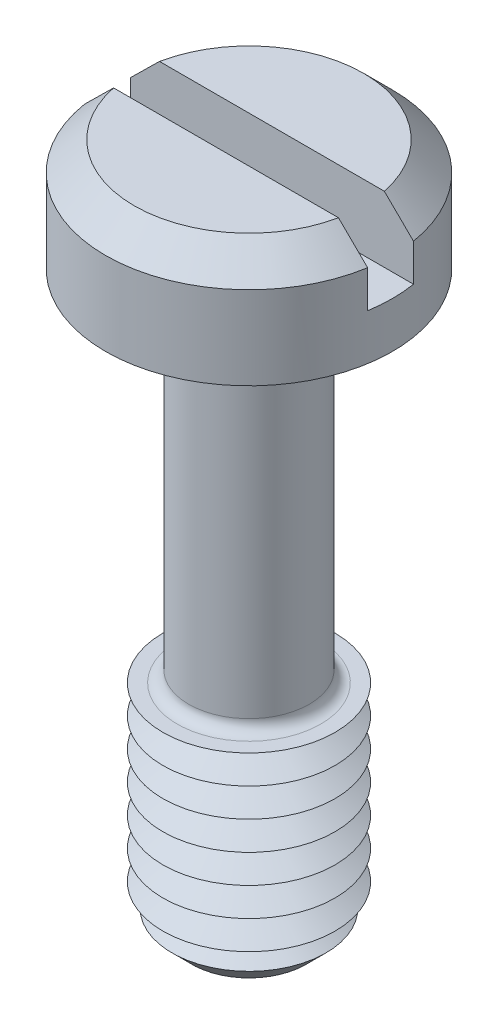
ISO-10303-21;
HEADER;
FILE_DESCRIPTION(('STEP AP214'),'2;1');
FILE_NAME('part.step','',(''),(''),'','','');
FILE_SCHEMA(('AUTOMOTIVE_DESIGN { 1 0 10303 214 1 1 1 1 }'));
ENDSEC;
DATA;
#1=APPLICATION_CONTEXT('core data for automotive mechanical design processes');
#2=APPLICATION_PROTOCOL_DEFINITION('international standard','automotive_design',2000,#1);
#3=PRODUCT_CONTEXT('',#1,'mechanical');
#4=PRODUCT('Part','Part','',(#3));
#5=PRODUCT_RELATED_PRODUCT_CATEGORY('part','',(#4));
#6=PRODUCT_DEFINITION_FORMATION('','',#4);
#7=PRODUCT_DEFINITION_CONTEXT('part definition',#1,'design');
#8=PRODUCT_DEFINITION('design','',#6,#7);
#9=PRODUCT_DEFINITION_SHAPE('','',#8);
#10=(LENGTH_UNIT() NAMED_UNIT(*) SI_UNIT(.MILLI.,.METRE.));
#11=(NAMED_UNIT(*) PLANE_ANGLE_UNIT() SI_UNIT($,.RADIAN.));
#12=(NAMED_UNIT(*) SI_UNIT($,.STERADIAN.) SOLID_ANGLE_UNIT());
#13=UNCERTAINTY_MEASURE_WITH_UNIT(LENGTH_MEASURE(1.E-05),#10,'distance_accuracy_value','');
#14=(GEOMETRIC_REPRESENTATION_CONTEXT(3) GLOBAL_UNCERTAINTY_ASSIGNED_CONTEXT((#13)) GLOBAL_UNIT_ASSIGNED_CONTEXT((#10,
#11,#12)) REPRESENTATION_CONTEXT('',''));
#15=CARTESIAN_POINT('',(0.,0.,0.));
#16=DIRECTION('',(0.,0.,1.));
#17=DIRECTION('',(1.,0.,0.));
#18=AXIS2_PLACEMENT_3D('',#15,#16,#17);
#19=CARTESIAN_POINT('',(0.,3.9,0.));
#20=DIRECTION('',(0.,1.,0.));
#21=DIRECTION('',(0.,0.,1.));
#22=AXIS2_PLACEMENT_3D('',#19,#20,#21);
#23=PLANE('',#22);
#24=DIRECTION('',(-1.,0.,0.));
#25=VECTOR('',#24,1.);
#26=CARTESIAN_POINT('',(5.,3.9,-0.8));
#27=LINE('',#26,#25);
#28=CARTESIAN_POINT('',(3.9191835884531,3.9,-0.8));
#29=VERTEX_POINT('',#28);
#30=CARTESIAN_POINT('',(-3.9191835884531,3.9,-0.8));
#31=VERTEX_POINT('',#30);
#32=EDGE_CURVE('E110',#29,#31,#27,.T.);
#33=ORIENTED_EDGE('',*,*,#32,.F.);
#34=CARTESIAN_POINT('',(0.,3.9,0.));
#35=DIRECTION('',(0.,1.,0.));
#36=DIRECTION('',(0.,0.,1.));
#37=AXIS2_PLACEMENT_3D('',#34,#35,#36);
#38=CIRCLE('',#37,4.00000000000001);
#39=EDGE_CURVE('E113',#29,#31,#38,.T.);
#40=ORIENTED_EDGE('',*,*,#39,.T.);
#41=EDGE_LOOP('',(#33,#40));
#42=FACE_BOUND('',#41,.T.);
#43=ADVANCED_FACE('F39',(#42),#23,.T.);
#44=CARTESIAN_POINT('',(0.,3.9,0.));
#45=DIRECTION('',(0.,-1.,0.));
#46=DIRECTION('',(0.,0.,-1.));
#47=AXIS2_PLACEMENT_3D('',#44,#45,#46);
#48=CONICAL_SURFACE('',#47,4.00000000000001,0.785398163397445);
#49=CARTESIAN_POINT('',(11.0010756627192,-3.13012537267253,-0.8));
#50=CARTESIAN_POINT('',(10.6180645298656,-2.74813121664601,-0.8));
#51=CARTESIAN_POINT('',(10.2350087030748,-2.36618183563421,-0.8));
#52=CARTESIAN_POINT('',(9.4687374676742,-1.60241986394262,-0.8));
#53=CARTESIAN_POINT('',(9.08552205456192,-1.2206072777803,-0.8));
#54=CARTESIAN_POINT('',(8.31861292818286,-0.456918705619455,-0.8));
#55=CARTESIAN_POINT('',(7.93491906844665,-0.0750428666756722,-0.8));
#56=CARTESIAN_POINT('',(7.16722555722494,0.688378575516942,-0.8));
#57=CARTESIAN_POINT('',(6.78322591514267,1.06992418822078,-0.8));
#58=CARTESIAN_POINT('',(6.01856215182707,1.82868912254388,-0.8));
#59=CARTESIAN_POINT('',(5.63790309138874,2.20591354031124,-0.8));
#60=CARTESIAN_POINT('',(5.06622054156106,2.77108317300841,-0.8));
#61=CARTESIAN_POINT('',(4.87553531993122,2.95937045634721,-0.8));
#62=CARTESIAN_POINT('',(4.49384424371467,3.33561647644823,-0.8));
#63=CARTESIAN_POINT('',(4.302838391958,3.52357521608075,-0.8));
#64=CARTESIAN_POINT('',(3.92044271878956,3.89893397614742,-0.8));
#65=CARTESIAN_POINT('',(3.72905310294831,4.08633420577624,-0.8));
#66=CARTESIAN_POINT('',(3.34554223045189,4.46039762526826,-0.8));
#67=CARTESIAN_POINT('',(3.15342094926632,4.64706078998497,-0.8));
#68=CARTESIAN_POINT('',(2.76802565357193,5.0191369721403,-0.8));
#69=CARTESIAN_POINT('',(2.57475182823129,5.20455018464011,-0.8));
#70=CARTESIAN_POINT('',(2.28318236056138,5.48091108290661,-0.8));
#71=CARTESIAN_POINT('',(2.1857187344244,5.5727357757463,-0.8));
#72=CARTESIAN_POINT('',(1.98998431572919,5.75552004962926,-0.8));
#73=CARTESIAN_POINT('',(1.89171354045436,5.84647964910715,-0.8));
#74=CARTESIAN_POINT('',(1.76578543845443,5.96147491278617,-0.8));
#75=CARTESIAN_POINT('',(1.73869031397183,5.986126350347,-0.8));
#76=CARTESIAN_POINT('',(1.68439529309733,6.03531372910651,-0.8));
#77=CARTESIAN_POINT('',(1.65719539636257,6.05984966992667,-0.8));
#78=CARTESIAN_POINT('',(1.5754162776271,6.13326356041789,-0.8));
#79=CARTESIAN_POINT('',(1.52066027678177,6.18194515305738,-0.8));
#80=CARTESIAN_POINT('',(1.41038257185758,6.27874171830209,-0.8));
#81=CARTESIAN_POINT('',(1.35485918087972,6.32685477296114,-0.8));
#82=CARTESIAN_POINT('',(1.24299231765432,6.42210730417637,-0.8));
#83=CARTESIAN_POINT('',(1.18664895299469,6.4692469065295,-0.8));
#84=CARTESIAN_POINT('',(1.07845249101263,6.55754663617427,-0.8));
#85=CARTESIAN_POINT('',(1.02670624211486,6.5988371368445,-0.8));
#86=CARTESIAN_POINT('',(0.92196100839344,6.67979338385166,-0.8));
#87=CARTESIAN_POINT('',(0.868962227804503,6.71945939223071,-0.8));
#88=CARTESIAN_POINT('',(0.761295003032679,6.79630361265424,-0.8));
#89=CARTESIAN_POINT('',(0.706629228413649,6.8334855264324,-0.8));
#90=CARTESIAN_POINT('',(0.594896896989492,6.90399895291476,-0.8));
#91=CARTESIAN_POINT('',(0.537833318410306,6.93733506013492,-0.8));
#92=CARTESIAN_POINT('',(0.428390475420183,6.9935634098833,-0.8));
#93=CARTESIAN_POINT('',(0.376435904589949,7.01726022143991,-0.8));
#94=CARTESIAN_POINT('',(0.269759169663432,7.05717670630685,-0.8));
#95=CARTESIAN_POINT('',(0.215046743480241,7.07342088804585,-0.8));
#96=CARTESIAN_POINT('',(0.113016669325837,7.09332110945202,-0.8));
#97=CARTESIAN_POINT('',(0.0660435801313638,7.098660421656,-0.8));
#98=CARTESIAN_POINT('',(-0.0280587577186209,7.10088875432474,-0.8));
#99=CARTESIAN_POINT('',(-0.0751877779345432,7.09778705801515,-0.8));
#100=CARTESIAN_POINT('',(-0.180723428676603,7.08192474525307,-0.8));
#101=CARTESIAN_POINT('',(-0.238762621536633,7.06679554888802,-0.8));
#102=CARTESIAN_POINT('',(-0.323499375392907,7.03748409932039,-0.8));
#103=CARTESIAN_POINT('',(-0.351441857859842,7.02656594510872,-0.8));
#104=CARTESIAN_POINT('',(-0.406569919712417,7.00295901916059,-0.8));
#105=CARTESIAN_POINT('',(-0.433755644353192,6.99027059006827,-0.8));
#106=CARTESIAN_POINT('',(-0.504673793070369,6.954892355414,-0.8));
#107=CARTESIAN_POINT('',(-0.547808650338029,6.93101671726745,-0.8));
#108=CARTESIAN_POINT('',(-0.632566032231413,6.88069648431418,-0.8));
#109=CARTESIAN_POINT('',(-0.674187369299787,6.85424992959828,-0.8));
#110=CARTESIAN_POINT('',(-0.756326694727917,6.79950439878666,-0.8));
#111=CARTESIAN_POINT('',(-0.796841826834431,6.77120117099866,-0.8));
#112=CARTESIAN_POINT('',(-0.876938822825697,6.71329852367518,-0.8));
#113=CARTESIAN_POINT('',(-0.916520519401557,6.68369887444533,-0.8));
#114=CARTESIAN_POINT('',(-1.03465904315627,6.59312324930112,-0.8));
#115=CARTESIAN_POINT('',(-1.11211338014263,6.53071425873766,-0.8));
#116=CARTESIAN_POINT('',(-1.26505454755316,6.40381418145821,-0.8));
#117=CARTESIAN_POINT('',(-1.34054439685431,6.33932667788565,-0.8));
#118=CARTESIAN_POINT('',(-1.48913173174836,6.20997083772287,-0.8));
#119=CARTESIAN_POINT('',(-1.56224816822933,6.14512422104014,-0.8));
#120=CARTESIAN_POINT('',(-1.70765393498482,6.01451044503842,-0.8));
#121=CARTESIAN_POINT('',(-1.77994324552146,5.94874326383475,-0.8));
#122=CARTESIAN_POINT('',(-1.99594639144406,5.75046596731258,-0.8));
#123=CARTESIAN_POINT('',(-2.13877767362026,5.61699583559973,-0.8));
#124=CARTESIAN_POINT('',(-2.42324632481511,5.34853800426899,-0.8));
#125=CARTESIAN_POINT('',(-2.56488247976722,5.21354902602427,-0.8));
#126=CARTESIAN_POINT('',(-2.84730929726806,4.94270932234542,-0.8));
#127=CARTESIAN_POINT('',(-2.98810001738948,4.80685865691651,-0.8));
#128=CARTESIAN_POINT('',(-3.26818763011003,4.53549974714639,-0.8));
#129=CARTESIAN_POINT('',(-3.40748821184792,4.39999530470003,-0.8));
#130=CARTESIAN_POINT('',(-3.68570899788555,4.12859172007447,-0.8));
#131=CARTESIAN_POINT('',(-3.82462919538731,3.99269257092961,-0.8));
#132=CARTESIAN_POINT('',(-4.24087543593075,3.58468153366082,-0.8));
#133=CARTESIAN_POINT('',(-4.51779300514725,3.31215310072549,-0.8));
#134=CARTESIAN_POINT('',(-5.05279381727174,2.78443938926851,-0.8));
#135=CARTESIAN_POINT('',(-5.31091639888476,2.52929393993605,-0.8));
#136=CARTESIAN_POINT('',(-5.82680751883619,2.01864429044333,-0.8));
#137=CARTESIAN_POINT('',(-6.08457605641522,1.76314008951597,-0.8));
#138=CARTESIAN_POINT('',(-6.85760508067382,0.996194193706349,-0.8));
#139=CARTESIAN_POINT('',(-7.37251152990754,0.484395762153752,-0.8));
#140=CARTESIAN_POINT('',(-8.40657233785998,-0.544392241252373,-0.8));
#141=CARTESIAN_POINT('',(-8.92572224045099,-1.0613862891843,-0.8));
#142=CARTESIAN_POINT('',(-9.96362871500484,-2.09560660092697,-0.8));
#143=CARTESIAN_POINT('',(-10.4823853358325,-2.61283281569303,-0.8));
#144=CARTESIAN_POINT('',(-11.0010756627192,-3.13012537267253,-0.8));
#145=B_SPLINE_CURVE_WITH_KNOTS('',3,(#49,#50,#51,#52,#53,#54,#55,#56,#57,#58,#59,#60,#61,#62,
#63,#64,#65,#66,#67,#68,#69,#70,#71,#72,#73,#74,#75,#76,#77,#78,#79,#80,#81,#82,#83,#84,#85,#86,
#87,#88,#89,#90,#91,#92,#93,#94,#95,#96,#97,#98,#99,#100,#101,#102,#103,#104,#105,#106,#107,
#108,#109,#110,#111,#112,#113,#114,#115,#116,#117,#118,#119,#120,#121,#122,#123,#124,#125,#126,
#127,#128,#129,#130,#131,#132,#133,#134,#135,#136,#137,#138,#139,#140,#141,#142,#143,#144),
.UNSPECIFIED.,.F.,.F.,(4,2,2,2,2,2,2,2,2,2,2,2,2,2,2,2,2,2,2,2,2,2,2,2,2,2,2,2,2,2,2,2,2,2,2,2,
2,2,2,2,2,2,2,2,2,2,2,4),(0.,1.62282275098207,3.24569489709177,4.86971791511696,
6.49369278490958,8.10142191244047,8.90535980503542,9.70929063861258,10.5128682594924,
11.3164730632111,12.1199494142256,12.5216659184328,12.9233738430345,13.0332669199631,
13.1431603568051,13.3629580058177,13.5833578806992,13.8037290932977,14.0023112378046,
14.2008612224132,14.3991084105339,14.5971162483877,14.7680800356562,14.9384774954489,
15.0795987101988,15.2205647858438,15.3993585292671,15.4893211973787,15.579266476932,
15.7270328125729,15.8749126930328,16.0231439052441,16.1714014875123,16.4697244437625,
16.7675580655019,17.0607348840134,17.3539186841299,17.9403574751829,18.5273336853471,
19.114269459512,19.697273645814,20.2802881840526,21.4458742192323,22.534698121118,
23.6235243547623,25.8015035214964,27.999501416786,30.1971550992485),.UNSPECIFIED.);
#146=CARTESIAN_POINT('',(4.93558507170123,2.9,-0.8));
#147=VERTEX_POINT('',#146);
#148=EDGE_CURVE('E252',#147,#29,#145,.T.);
#149=ORIENTED_EDGE('',*,*,#148,.F.);
#150=CARTESIAN_POINT('',(0.,2.9,0.));
#151=DIRECTION('',(0.,1.,0.));
#152=DIRECTION('',(0.,0.,1.));
#153=AXIS2_PLACEMENT_3D('',#150,#151,#152);
#154=CIRCLE('',#153,5.);
#155=CARTESIAN_POINT('',(-4.93558507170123,2.9,-0.8));
#156=VERTEX_POINT('',#155);
#157=EDGE_CURVE('E128',#156,#147,#154,.F.);
#158=ORIENTED_EDGE('',*,*,#157,.F.);
#159=EDGE_CURVE('E102',#31,#156,#145,.T.);
#160=ORIENTED_EDGE('',*,*,#159,.F.);
#161=ORIENTED_EDGE('',*,*,#39,.F.);
#162=EDGE_LOOP('',(#149,#158,#160,#161));
#163=FACE_BOUND('',#162,.T.);
#164=ADVANCED_FACE('F214',(#163),#48,.T.);
#165=CARTESIAN_POINT('',(0.,-20.,0.));
#166=DIRECTION('',(0.,1.,0.));
#167=DIRECTION('',(0.,0.,1.));
#168=AXIS2_PLACEMENT_3D('',#165,#166,#167);
#169=CYLINDRICAL_SURFACE('',#168,2.1);
#170=CARTESIAN_POINT('',(0.,-12.1,0.));
#171=DIRECTION('',(0.,-1.,0.));
#172=DIRECTION('',(0.,0.,-1.));
#173=AXIS2_PLACEMENT_3D('',#170,#171,#172);
#174=CIRCLE('',#173,2.1);
#175=CARTESIAN_POINT('',(0.,-12.1,-2.1));
#176=VERTEX_POINT('',#175);
#177=EDGE_CURVE('E123',#176,#176,#174,.F.);
#178=ORIENTED_EDGE('',*,*,#177,.T.);
#179=EDGE_LOOP('',(#178));
#180=FACE_BOUND('',#179,.T.);
#181=CARTESIAN_POINT('',(0.,-0.400000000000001,0.));
#182=DIRECTION('',(0.,1.,0.));
#183=DIRECTION('',(0.,0.,1.));
#184=AXIS2_PLACEMENT_3D('',#181,#182,#183);
#185=CIRCLE('',#184,2.1);
#186=CARTESIAN_POINT('',(0.,-0.400000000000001,2.1));
#187=VERTEX_POINT('',#186);
#188=EDGE_CURVE('E350',#187,#187,#185,.F.);
#189=ORIENTED_EDGE('',*,*,#188,.T.);
#190=EDGE_LOOP('',(#189));
#191=FACE_BOUND('',#190,.T.);
#192=ADVANCED_FACE('F210',(#180,#191),#169,.T.);
#193=CARTESIAN_POINT('',(0.,3.9,0.));
#194=DIRECTION('',(0.,-1.,0.));
#195=DIRECTION('',(0.,0.,-1.));
#196=AXIS2_PLACEMENT_3D('',#193,#194,#195);
#197=CYLINDRICAL_SURFACE('',#196,5.);
#198=ORIENTED_EDGE('',*,*,#157,.T.);
#199=DIRECTION('',(0.,-1.,0.));
#200=VECTOR('',#199,1.);
#201=CARTESIAN_POINT('',(4.93558507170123,3.9,-0.8));
#202=LINE('',#201,#200);
#203=CARTESIAN_POINT('',(4.93558507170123,1.6,-0.8));
#204=VERTEX_POINT('',#203);
#205=EDGE_CURVE('E64',#147,#204,#202,.T.);
#206=ORIENTED_EDGE('',*,*,#205,.T.);
#207=CARTESIAN_POINT('',(0.,1.6,0.));
#208=DIRECTION('',(0.,1.,0.));
#209=DIRECTION('',(0.,0.,1.));
#210=AXIS2_PLACEMENT_3D('',#207,#208,#209);
#211=CIRCLE('',#210,5.);
#212=CARTESIAN_POINT('',(4.93558507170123,1.6,0.8));
#213=VERTEX_POINT('',#212);
#214=EDGE_CURVE('E11',#213,#204,#211,.T.);
#215=ORIENTED_EDGE('',*,*,#214,.F.);
#216=DIRECTION('',(0.,-1.,0.));
#217=VECTOR('',#216,1.);
#218=CARTESIAN_POINT('',(4.93558507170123,3.9,0.8));
#219=LINE('',#218,#217);
#220=CARTESIAN_POINT('',(4.93558507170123,2.9,0.8));
#221=VERTEX_POINT('',#220);
#222=EDGE_CURVE('E268',#213,#221,#219,.F.);
#223=ORIENTED_EDGE('',*,*,#222,.T.);
#224=CARTESIAN_POINT('',(-4.93558507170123,2.9,0.8));
#225=VERTEX_POINT('',#224);
#226=EDGE_CURVE('E120',#221,#225,#154,.F.);
#227=ORIENTED_EDGE('',*,*,#226,.T.);
#228=DIRECTION('',(0.,-1.,0.));
#229=VECTOR('',#228,1.);
#230=CARTESIAN_POINT('',(-4.93558507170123,3.9,0.8));
#231=LINE('',#230,#229);
#232=CARTESIAN_POINT('',(-4.93558507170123,1.6,0.8));
#233=VERTEX_POINT('',#232);
#234=EDGE_CURVE('E96',#225,#233,#231,.T.);
#235=ORIENTED_EDGE('',*,*,#234,.T.);
#236=CARTESIAN_POINT('',(-4.93558507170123,1.6,-0.8));
#237=VERTEX_POINT('',#236);
#238=EDGE_CURVE('E44',#237,#233,#211,.T.);
#239=ORIENTED_EDGE('',*,*,#238,.F.);
#240=DIRECTION('',(0.,-1.,0.));
#241=VECTOR('',#240,1.);
#242=CARTESIAN_POINT('',(-4.93558507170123,3.9,-0.8));
#243=LINE('',#242,#241);
#244=EDGE_CURVE('E273',#237,#156,#243,.F.);
#245=ORIENTED_EDGE('',*,*,#244,.T.);
#246=EDGE_LOOP('',(#198,#206,#215,#223,#227,#235,#239,#245));
#247=FACE_BOUND('',#246,.T.);
#248=CARTESIAN_POINT('',(0.,0.,0.));
#249=DIRECTION('',(0.,1.,0.));
#250=DIRECTION('',(0.,0.,1.));
#251=AXIS2_PLACEMENT_3D('',#248,#249,#250);
#252=CIRCLE('',#251,5.);
#253=CARTESIAN_POINT('',(0.,0.,5.));
#254=VERTEX_POINT('',#253);
#255=EDGE_CURVE('E336',#254,#254,#252,.T.);
#256=ORIENTED_EDGE('',*,*,#255,.T.);
#257=EDGE_LOOP('',(#256));
#258=FACE_BOUND('',#257,.T.);
#259=ADVANCED_FACE('F213',(#247,#258),#197,.T.);
#260=DIRECTION('',(1.,0.,0.));
#261=VECTOR('',#260,1.);
#262=CARTESIAN_POINT('',(5.,3.9,0.8));
#263=LINE('',#262,#261);
#264=CARTESIAN_POINT('',(-3.9191835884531,3.9,0.8));
#265=VERTEX_POINT('',#264);
#266=CARTESIAN_POINT('',(3.9191835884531,3.9,0.8));
#267=VERTEX_POINT('',#266);
#268=EDGE_CURVE('E56',#265,#267,#263,.T.);
#269=ORIENTED_EDGE('',*,*,#268,.F.);
#270=EDGE_CURVE('E108',#265,#267,#38,.T.);
#271=ORIENTED_EDGE('',*,*,#270,.T.);
#272=EDGE_LOOP('',(#269,#271));
#273=FACE_BOUND('',#272,.T.);
#274=ADVANCED_FACE('F107',(#273),#23,.T.);
#275=CARTESIAN_POINT('',(0.,0.,0.));
#276=DIRECTION('',(0.,1.,0.));
#277=DIRECTION('',(0.,0.,1.));
#278=AXIS2_PLACEMENT_3D('',#275,#276,#277);
#279=PLANE('',#278);
#280=CARTESIAN_POINT('',(0.,0.,0.));
#281=DIRECTION('',(0.,1.,0.));
#282=DIRECTION('',(0.,0.,1.));
#283=AXIS2_PLACEMENT_3D('',#280,#281,#282);
#284=CIRCLE('',#283,2.5);
#285=CARTESIAN_POINT('',(0.,0.,2.5));
#286=VERTEX_POINT('',#285);
#287=EDGE_CURVE('E114',#286,#286,#284,.T.);
#288=ORIENTED_EDGE('',*,*,#287,.T.);
#289=EDGE_LOOP('',(#288));
#290=FACE_BOUND('',#289,.T.);
#291=ORIENTED_EDGE('',*,*,#255,.F.);
#292=EDGE_LOOP('',(#291));
#293=FACE_BOUND('',#292,.T.);
#294=ADVANCED_FACE('F204',(#290,#293),#279,.F.);
#295=CARTESIAN_POINT('',(0.,-12.5,0.));
#296=DIRECTION('',(0.,-1.,0.));
#297=DIRECTION('',(0.,0.,-1.));
#298=AXIS2_PLACEMENT_3D('',#295,#296,#297);
#299=PLANE('',#298);
#300=CARTESIAN_POINT('',(0.,-12.5,0.));
#301=DIRECTION('',(0.,-1.,0.));
#302=DIRECTION('',(0.,0.,-1.));
#303=AXIS2_PLACEMENT_3D('',#300,#301,#302);
#304=CIRCLE('',#303,2.5);
#305=CARTESIAN_POINT('',(0.,-12.5,-2.5));
#306=VERTEX_POINT('',#305);
#307=EDGE_CURVE('E343',#306,#306,#304,.T.);
#308=ORIENTED_EDGE('',*,*,#307,.T.);
#309=EDGE_LOOP('',(#308));
#310=FACE_BOUND('',#309,.T.);
#311=CARTESIAN_POINT('',(0.,-12.5,0.));
#312=DIRECTION('',(0.,1.,0.));
#313=DIRECTION('',(0.,0.,1.));
#314=AXIS2_PLACEMENT_3D('',#311,#312,#313);
#315=CIRCLE('',#314,3.);
#316=CARTESIAN_POINT('',(0.,-12.5,3.));
#317=VERTEX_POINT('',#316);
#318=EDGE_CURVE('E333',#317,#317,#315,.T.);
#319=ORIENTED_EDGE('',*,*,#318,.T.);
#320=EDGE_LOOP('',(#319));
#321=FACE_BOUND('',#320,.T.);
#322=ADVANCED_FACE('F200',(#310,#321),#299,.F.);
#323=CARTESIAN_POINT('',(0.,-13.,0.));
#324=DIRECTION('',(0.,1.,0.));
#325=DIRECTION('',(0.,0.,1.));
#326=AXIS2_PLACEMENT_3D('',#323,#324,#325);
#327=CONICAL_SURFACE('',#326,2.13397459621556,1.0471975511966);
#328=ORIENTED_EDGE('',*,*,#318,.F.);
#329=EDGE_LOOP('',(#328));
#330=FACE_BOUND('',#329,.T.);
#331=CARTESIAN_POINT('',(0.,-13.,0.));
#332=DIRECTION('',(0.,1.,0.));
#333=DIRECTION('',(0.,0.,1.));
#334=AXIS2_PLACEMENT_3D('',#331,#332,#333);
#335=CIRCLE('',#334,2.13397459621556);
#336=CARTESIAN_POINT('',(0.,-13.,2.13397459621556));
#337=VERTEX_POINT('',#336);
#338=EDGE_CURVE('E330',#337,#337,#335,.T.);
#339=ORIENTED_EDGE('',*,*,#338,.T.);
#340=EDGE_LOOP('',(#339));
#341=FACE_BOUND('',#340,.T.);
#342=ADVANCED_FACE('F196',(#330,#341),#327,.T.);
#343=CARTESIAN_POINT('',(0.,-13.5,0.));
#344=DIRECTION('',(0.,-1.,0.));
#345=DIRECTION('',(0.,0.,-1.));
#346=AXIS2_PLACEMENT_3D('',#343,#344,#345);
#347=CONICAL_SURFACE('',#346,3.,1.0471975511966);
#348=ORIENTED_EDGE('',*,*,#338,.F.);
#349=EDGE_LOOP('',(#348));
#350=FACE_BOUND('',#349,.T.);
#351=CARTESIAN_POINT('',(0.,-13.5,0.));
#352=DIRECTION('',(0.,1.,0.));
#353=DIRECTION('',(0.,0.,1.));
#354=AXIS2_PLACEMENT_3D('',#351,#352,#353);
#355=CIRCLE('',#354,3.);
#356=CARTESIAN_POINT('',(0.,-13.5,3.));
#357=VERTEX_POINT('',#356);
#358=EDGE_CURVE('E327',#357,#357,#355,.T.);
#359=ORIENTED_EDGE('',*,*,#358,.T.);
#360=EDGE_LOOP('',(#359));
#361=FACE_BOUND('',#360,.T.);
#362=ADVANCED_FACE('F192',(#350,#361),#347,.T.);
#363=CARTESIAN_POINT('',(0.,-14.,0.));
#364=DIRECTION('',(0.,1.,0.));
#365=DIRECTION('',(0.,0.,1.));
#366=AXIS2_PLACEMENT_3D('',#363,#364,#365);
#367=CONICAL_SURFACE('',#366,2.13397459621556,1.0471975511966);
#368=ORIENTED_EDGE('',*,*,#358,.F.);
#369=EDGE_LOOP('',(#368));
#370=FACE_BOUND('',#369,.T.);
#371=CARTESIAN_POINT('',(0.,-14.,0.));
#372=DIRECTION('',(0.,1.,0.));
#373=DIRECTION('',(0.,0.,1.));
#374=AXIS2_PLACEMENT_3D('',#371,#372,#373);
#375=CIRCLE('',#374,2.13397459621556);
#376=CARTESIAN_POINT('',(0.,-14.,2.13397459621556));
#377=VERTEX_POINT('',#376);
#378=EDGE_CURVE('E323',#377,#377,#375,.T.);
#379=ORIENTED_EDGE('',*,*,#378,.T.);
#380=EDGE_LOOP('',(#379));
#381=FACE_BOUND('',#380,.T.);
#382=ADVANCED_FACE('F188',(#370,#381),#367,.T.);
#383=CARTESIAN_POINT('',(0.,-14.5,0.));
#384=DIRECTION('',(0.,-1.,0.));
#385=DIRECTION('',(0.,0.,-1.));
#386=AXIS2_PLACEMENT_3D('',#383,#384,#385);
#387=CONICAL_SURFACE('',#386,3.,1.0471975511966);
#388=ORIENTED_EDGE('',*,*,#378,.F.);
#389=EDGE_LOOP('',(#388));
#390=FACE_BOUND('',#389,.T.);
#391=CARTESIAN_POINT('',(0.,-14.5,0.));
#392=DIRECTION('',(0.,1.,0.));
#393=DIRECTION('',(0.,0.,1.));
#394=AXIS2_PLACEMENT_3D('',#391,#392,#393);
#395=CIRCLE('',#394,3.);
#396=CARTESIAN_POINT('',(0.,-14.5,3.));
#397=VERTEX_POINT('',#396);
#398=EDGE_CURVE('E319',#397,#397,#395,.T.);
#399=ORIENTED_EDGE('',*,*,#398,.T.);
#400=EDGE_LOOP('',(#399));
#401=FACE_BOUND('',#400,.T.);
#402=ADVANCED_FACE('F184',(#390,#401),#387,.T.);
#403=CARTESIAN_POINT('',(0.,-15.,0.));
#404=DIRECTION('',(0.,1.,0.));
#405=DIRECTION('',(0.,0.,1.));
#406=AXIS2_PLACEMENT_3D('',#403,#404,#405);
#407=CONICAL_SURFACE('',#406,2.13397459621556,1.0471975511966);
#408=ORIENTED_EDGE('',*,*,#398,.F.);
#409=EDGE_LOOP('',(#408));
#410=FACE_BOUND('',#409,.T.);
#411=CARTESIAN_POINT('',(0.,-15.,0.));
#412=DIRECTION('',(0.,1.,0.));
#413=DIRECTION('',(0.,0.,1.));
#414=AXIS2_PLACEMENT_3D('',#411,#412,#413);
#415=CIRCLE('',#414,2.13397459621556);
#416=CARTESIAN_POINT('',(0.,-15.,2.13397459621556));
#417=VERTEX_POINT('',#416);
#418=EDGE_CURVE('E315',#417,#417,#415,.T.);
#419=ORIENTED_EDGE('',*,*,#418,.T.);
#420=EDGE_LOOP('',(#419));
#421=FACE_BOUND('',#420,.T.);
#422=ADVANCED_FACE('F180',(#410,#421),#407,.T.);
#423=CARTESIAN_POINT('',(0.,-15.5,0.));
#424=DIRECTION('',(0.,-1.,0.));
#425=DIRECTION('',(0.,0.,-1.));
#426=AXIS2_PLACEMENT_3D('',#423,#424,#425);
#427=CONICAL_SURFACE('',#426,3.,1.0471975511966);
#428=ORIENTED_EDGE('',*,*,#418,.F.);
#429=EDGE_LOOP('',(#428));
#430=FACE_BOUND('',#429,.T.);
#431=CARTESIAN_POINT('',(0.,-15.5,0.));
#432=DIRECTION('',(0.,1.,0.));
#433=DIRECTION('',(0.,0.,1.));
#434=AXIS2_PLACEMENT_3D('',#431,#432,#433);
#435=CIRCLE('',#434,3.);
#436=CARTESIAN_POINT('',(0.,-15.5,3.));
#437=VERTEX_POINT('',#436);
#438=EDGE_CURVE('E311',#437,#437,#435,.T.);
#439=ORIENTED_EDGE('',*,*,#438,.T.);
#440=EDGE_LOOP('',(#439));
#441=FACE_BOUND('',#440,.T.);
#442=ADVANCED_FACE('F176',(#430,#441),#427,.T.);
#443=CARTESIAN_POINT('',(0.,-16.,0.));
#444=DIRECTION('',(0.,1.,0.));
#445=DIRECTION('',(0.,0.,1.));
#446=AXIS2_PLACEMENT_3D('',#443,#444,#445);
#447=CONICAL_SURFACE('',#446,2.13397459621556,1.0471975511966);
#448=ORIENTED_EDGE('',*,*,#438,.F.);
#449=EDGE_LOOP('',(#448));
#450=FACE_BOUND('',#449,.T.);
#451=CARTESIAN_POINT('',(0.,-16.,0.));
#452=DIRECTION('',(0.,1.,0.));
#453=DIRECTION('',(0.,0.,1.));
#454=AXIS2_PLACEMENT_3D('',#451,#452,#453);
#455=CIRCLE('',#454,2.13397459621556);
#456=CARTESIAN_POINT('',(0.,-16.,2.13397459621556));
#457=VERTEX_POINT('',#456);
#458=EDGE_CURVE('E307',#457,#457,#455,.T.);
#459=ORIENTED_EDGE('',*,*,#458,.T.);
#460=EDGE_LOOP('',(#459));
#461=FACE_BOUND('',#460,.T.);
#462=ADVANCED_FACE('F172',(#450,#461),#447,.T.);
#463=CARTESIAN_POINT('',(0.,-16.5,0.));
#464=DIRECTION('',(0.,-1.,0.));
#465=DIRECTION('',(0.,0.,-1.));
#466=AXIS2_PLACEMENT_3D('',#463,#464,#465);
#467=CONICAL_SURFACE('',#466,3.,1.0471975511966);
#468=ORIENTED_EDGE('',*,*,#458,.F.);
#469=EDGE_LOOP('',(#468));
#470=FACE_BOUND('',#469,.T.);
#471=CARTESIAN_POINT('',(0.,-16.5,0.));
#472=DIRECTION('',(0.,1.,0.));
#473=DIRECTION('',(0.,0.,1.));
#474=AXIS2_PLACEMENT_3D('',#471,#472,#473);
#475=CIRCLE('',#474,3.);
#476=CARTESIAN_POINT('',(0.,-16.5,3.));
#477=VERTEX_POINT('',#476);
#478=EDGE_CURVE('E303',#477,#477,#475,.T.);
#479=ORIENTED_EDGE('',*,*,#478,.T.);
#480=EDGE_LOOP('',(#479));
#481=FACE_BOUND('',#480,.T.);
#482=ADVANCED_FACE('F168',(#470,#481),#467,.T.);
#483=CARTESIAN_POINT('',(0.,-17.,0.));
#484=DIRECTION('',(0.,1.,0.));
#485=DIRECTION('',(0.,0.,1.));
#486=AXIS2_PLACEMENT_3D('',#483,#484,#485);
#487=CONICAL_SURFACE('',#486,2.13397459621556,1.0471975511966);
#488=ORIENTED_EDGE('',*,*,#478,.F.);
#489=EDGE_LOOP('',(#488));
#490=FACE_BOUND('',#489,.T.);
#491=CARTESIAN_POINT('',(0.,-17.,0.));
#492=DIRECTION('',(0.,1.,0.));
#493=DIRECTION('',(0.,0.,1.));
#494=AXIS2_PLACEMENT_3D('',#491,#492,#493);
#495=CIRCLE('',#494,2.13397459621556);
#496=CARTESIAN_POINT('',(0.,-17.,2.13397459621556));
#497=VERTEX_POINT('',#496);
#498=EDGE_CURVE('E299',#497,#497,#495,.T.);
#499=ORIENTED_EDGE('',*,*,#498,.T.);
#500=EDGE_LOOP('',(#499));
#501=FACE_BOUND('',#500,.T.);
#502=ADVANCED_FACE('F164',(#490,#501),#487,.T.);
#503=CARTESIAN_POINT('',(0.,-17.5,0.));
#504=DIRECTION('',(0.,-1.,0.));
#505=DIRECTION('',(0.,0.,-1.));
#506=AXIS2_PLACEMENT_3D('',#503,#504,#505);
#507=CONICAL_SURFACE('',#506,3.,1.0471975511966);
#508=ORIENTED_EDGE('',*,*,#498,.F.);
#509=EDGE_LOOP('',(#508));
#510=FACE_BOUND('',#509,.T.);
#511=CARTESIAN_POINT('',(0.,-17.5,0.));
#512=DIRECTION('',(0.,1.,0.));
#513=DIRECTION('',(0.,0.,1.));
#514=AXIS2_PLACEMENT_3D('',#511,#512,#513);
#515=CIRCLE('',#514,3.);
#516=CARTESIAN_POINT('',(0.,-17.5,3.));
#517=VERTEX_POINT('',#516);
#518=EDGE_CURVE('E295',#517,#517,#515,.T.);
#519=ORIENTED_EDGE('',*,*,#518,.T.);
#520=EDGE_LOOP('',(#519));
#521=FACE_BOUND('',#520,.T.);
#522=ADVANCED_FACE('F160',(#510,#521),#507,.T.);
#523=CARTESIAN_POINT('',(0.,-18.,0.));
#524=DIRECTION('',(0.,1.,0.));
#525=DIRECTION('',(0.,0.,1.));
#526=AXIS2_PLACEMENT_3D('',#523,#524,#525);
#527=CONICAL_SURFACE('',#526,2.13397459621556,1.0471975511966);
#528=ORIENTED_EDGE('',*,*,#518,.F.);
#529=EDGE_LOOP('',(#528));
#530=FACE_BOUND('',#529,.T.);
#531=CARTESIAN_POINT('',(0.,-18.,0.));
#532=DIRECTION('',(0.,1.,0.));
#533=DIRECTION('',(0.,0.,1.));
#534=AXIS2_PLACEMENT_3D('',#531,#532,#533);
#535=CIRCLE('',#534,2.13397459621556);
#536=CARTESIAN_POINT('',(0.,-18.,2.13397459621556));
#537=VERTEX_POINT('',#536);
#538=EDGE_CURVE('E291',#537,#537,#535,.T.);
#539=ORIENTED_EDGE('',*,*,#538,.T.);
#540=EDGE_LOOP('',(#539));
#541=FACE_BOUND('',#540,.T.);
#542=ADVANCED_FACE('F156',(#530,#541),#527,.T.);
#543=CARTESIAN_POINT('',(0.,-18.5,0.));
#544=DIRECTION('',(0.,-1.,0.));
#545=DIRECTION('',(0.,0.,-1.));
#546=AXIS2_PLACEMENT_3D('',#543,#544,#545);
#547=CONICAL_SURFACE('',#546,3.,1.0471975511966);
#548=ORIENTED_EDGE('',*,*,#538,.F.);
#549=EDGE_LOOP('',(#548));
#550=FACE_BOUND('',#549,.T.);
#551=CARTESIAN_POINT('',(0.,-18.5,0.));
#552=DIRECTION('',(0.,1.,0.));
#553=DIRECTION('',(0.,0.,1.));
#554=AXIS2_PLACEMENT_3D('',#551,#552,#553);
#555=CIRCLE('',#554,3.);
#556=CARTESIAN_POINT('',(0.,-18.5,3.));
#557=VERTEX_POINT('',#556);
#558=EDGE_CURVE('E286',#557,#557,#555,.T.);
#559=ORIENTED_EDGE('',*,*,#558,.T.);
#560=EDGE_LOOP('',(#559));
#561=FACE_BOUND('',#560,.T.);
#562=ADVANCED_FACE('F152',(#550,#561),#547,.T.);
#563=CARTESIAN_POINT('',(0.,-19.,0.));
#564=DIRECTION('',(0.,1.,0.));
#565=DIRECTION('',(0.,0.,1.));
#566=AXIS2_PLACEMENT_3D('',#563,#564,#565);
#567=CONICAL_SURFACE('',#566,2.13397459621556,1.0471975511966);
#568=ORIENTED_EDGE('',*,*,#558,.F.);
#569=EDGE_LOOP('',(#568));
#570=FACE_BOUND('',#569,.T.);
#571=CARTESIAN_POINT('',(0.,-19.,0.));
#572=DIRECTION('',(0.,1.,0.));
#573=DIRECTION('',(0.,0.,1.));
#574=AXIS2_PLACEMENT_3D('',#571,#572,#573);
#575=CIRCLE('',#574,2.13397459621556);
#576=CARTESIAN_POINT('',(0.,-19.,2.13397459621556));
#577=VERTEX_POINT('',#576);
#578=EDGE_CURVE('E282',#577,#577,#575,.T.);
#579=ORIENTED_EDGE('',*,*,#578,.T.);
#580=EDGE_LOOP('',(#579));
#581=FACE_BOUND('',#580,.T.);
#582=ADVANCED_FACE('F148',(#570,#581),#567,.T.);
#583=CARTESIAN_POINT('',(0.,-19.5,0.));
#584=DIRECTION('',(0.,-1.,0.));
#585=DIRECTION('',(0.,0.,-1.));
#586=AXIS2_PLACEMENT_3D('',#583,#584,#585);
#587=CONICAL_SURFACE('',#586,3.,1.0471975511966);
#588=CARTESIAN_POINT('',(0.,-19.3169872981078,0.));
#589=DIRECTION('',(0.,-1.,0.));
#590=DIRECTION('',(0.,0.,-1.));
#591=AXIS2_PLACEMENT_3D('',#588,#589,#590);
#592=CIRCLE('',#591,2.68301270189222);
#593=CARTESIAN_POINT('',(0.,-19.3169872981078,-2.68301270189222));
#594=VERTEX_POINT('',#593);
#595=EDGE_CURVE('E290',#594,#594,#592,.F.);
#596=ORIENTED_EDGE('',*,*,#595,.T.);
#597=EDGE_LOOP('',(#596));
#598=FACE_BOUND('',#597,.T.);
#599=ORIENTED_EDGE('',*,*,#578,.F.);
#600=EDGE_LOOP('',(#599));
#601=FACE_BOUND('',#600,.T.);
#602=ADVANCED_FACE('F144',(#598,#601),#587,.T.);
#603=CARTESIAN_POINT('',(0.,-20.,0.));
#604=DIRECTION('',(0.,-1.,0.));
#605=DIRECTION('',(0.,0.,-1.));
#606=AXIS2_PLACEMENT_3D('',#603,#604,#605);
#607=PLANE('',#606);
#608=CARTESIAN_POINT('',(0.,-20.,0.));
#609=DIRECTION('',(0.,-1.,0.));
#610=DIRECTION('',(0.,0.,-1.));
#611=AXIS2_PLACEMENT_3D('',#608,#609,#610);
#612=CIRCLE('',#611,2.);
#613=CARTESIAN_POINT('',(0.,-20.,-2.));
#614=VERTEX_POINT('',#613);
#615=EDGE_CURVE('E340',#614,#614,#612,.T.);
#616=ORIENTED_EDGE('',*,*,#615,.T.);
#617=EDGE_LOOP('',(#616));
#618=FACE_BOUND('',#617,.T.);
#619=ADVANCED_FACE('F147',(#618),#607,.T.);
#620=CARTESIAN_POINT('',(0.,-20.,0.));
#621=DIRECTION('',(0.,1.,0.));
#622=DIRECTION('',(0.,0.,1.));
#623=AXIS2_PLACEMENT_3D('',#620,#621,#622);
#624=CONICAL_SURFACE('',#623,2.,0.785398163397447);
#625=ORIENTED_EDGE('',*,*,#595,.F.);
#626=EDGE_LOOP('',(#625));
#627=FACE_BOUND('',#626,.T.);
#628=ORIENTED_EDGE('',*,*,#615,.F.);
#629=EDGE_LOOP('',(#628));
#630=FACE_BOUND('',#629,.T.);
#631=ADVANCED_FACE('F208',(#627,#630),#624,.T.);
#632=CARTESIAN_POINT('',(0.,-12.1,0.));
#633=DIRECTION('',(0.,-1.,0.));
#634=DIRECTION('',(0.,0.,-1.));
#635=AXIS2_PLACEMENT_3D('',#632,#633,#634);
#636=TOROIDAL_SURFACE('',#635,2.5,0.4);
#637=ORIENTED_EDGE('',*,*,#177,.F.);
#638=EDGE_LOOP('',(#637));
#639=FACE_BOUND('',#638,.T.);
#640=ORIENTED_EDGE('',*,*,#307,.F.);
#641=EDGE_LOOP('',(#640));
#642=FACE_BOUND('',#641,.T.);
#643=ADVANCED_FACE('F226',(#639,#642),#636,.F.);
#644=CARTESIAN_POINT('',(0.,-0.400000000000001,0.));
#645=DIRECTION('',(0.,1.,0.));
#646=DIRECTION('',(0.,0.,1.));
#647=AXIS2_PLACEMENT_3D('',#644,#645,#646);
#648=TOROIDAL_SURFACE('',#647,2.5,0.4);
#649=ORIENTED_EDGE('',*,*,#287,.F.);
#650=EDGE_LOOP('',(#649));
#651=FACE_BOUND('',#650,.T.);
#652=ORIENTED_EDGE('',*,*,#188,.F.);
#653=EDGE_LOOP('',(#652));
#654=FACE_BOUND('',#653,.T.);
#655=ADVANCED_FACE('F229',(#651,#654),#648,.F.);
#656=CARTESIAN_POINT('',(-11.0010756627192,-3.13012537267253,0.8));
#657=CARTESIAN_POINT('',(-10.6180645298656,-2.74813121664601,0.8));
#658=CARTESIAN_POINT('',(-10.2350087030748,-2.36618183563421,0.8));
#659=CARTESIAN_POINT('',(-9.4687374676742,-1.60241986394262,0.8));
#660=CARTESIAN_POINT('',(-9.08552205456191,-1.22060727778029,0.8));
#661=CARTESIAN_POINT('',(-8.31861292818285,-0.456918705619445,0.8));
#662=CARTESIAN_POINT('',(-7.93491906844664,-0.075042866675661,0.8));
#663=CARTESIAN_POINT('',(-7.16722555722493,0.688378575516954,0.8));
#664=CARTESIAN_POINT('',(-6.78322591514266,1.06992418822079,0.8));
#665=CARTESIAN_POINT('',(-6.01856215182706,1.8286891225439,0.8));
#666=CARTESIAN_POINT('',(-5.63790309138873,2.20591354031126,0.8));
#667=CARTESIAN_POINT('',(-5.06622054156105,2.77108317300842,0.8));
#668=CARTESIAN_POINT('',(-4.87553531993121,2.95937045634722,0.8));
#669=CARTESIAN_POINT('',(-4.49384424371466,3.33561647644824,0.8));
#670=CARTESIAN_POINT('',(-4.302838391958,3.52357521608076,0.8));
#671=CARTESIAN_POINT('',(-3.92044271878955,3.89893397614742,0.8));
#672=CARTESIAN_POINT('',(-3.7290531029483,4.08633420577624,0.8));
#673=CARTESIAN_POINT('',(-3.34554223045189,4.46039762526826,0.8));
#674=CARTESIAN_POINT('',(-3.15342094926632,4.64706078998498,0.8));
#675=CARTESIAN_POINT('',(-2.76802565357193,5.0191369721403,0.8));
#676=CARTESIAN_POINT('',(-2.57475182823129,5.20455018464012,0.8));
#677=CARTESIAN_POINT('',(-2.28318236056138,5.48091108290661,0.8));
#678=CARTESIAN_POINT('',(-2.1857187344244,5.5727357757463,0.8));
#679=CARTESIAN_POINT('',(-1.98998431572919,5.75552004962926,0.8));
#680=CARTESIAN_POINT('',(-1.89171354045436,5.84647964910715,0.8));
#681=CARTESIAN_POINT('',(-1.76578543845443,5.96147491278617,0.8));
#682=CARTESIAN_POINT('',(-1.73869031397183,5.986126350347,0.8));
#683=CARTESIAN_POINT('',(-1.68439529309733,6.03531372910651,0.8));
#684=CARTESIAN_POINT('',(-1.65719539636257,6.05984966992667,0.8));
#685=CARTESIAN_POINT('',(-1.5754162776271,6.13326356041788,0.8));
#686=CARTESIAN_POINT('',(-1.52066027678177,6.18194515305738,0.8));
#687=CARTESIAN_POINT('',(-1.41038257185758,6.27874171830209,0.8));
#688=CARTESIAN_POINT('',(-1.35485918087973,6.32685477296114,0.8));
#689=CARTESIAN_POINT('',(-1.24299231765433,6.42210730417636,0.8));
#690=CARTESIAN_POINT('',(-1.18664895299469,6.46924690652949,0.8));
#691=CARTESIAN_POINT('',(-1.07845249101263,6.55754663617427,0.8));
#692=CARTESIAN_POINT('',(-1.02670624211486,6.5988371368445,0.8));
#693=CARTESIAN_POINT('',(-0.921961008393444,6.67979338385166,0.8));
#694=CARTESIAN_POINT('',(-0.868962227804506,6.71945939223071,0.8));
#695=CARTESIAN_POINT('',(-0.761295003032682,6.79630361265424,0.8));
#696=CARTESIAN_POINT('',(-0.706629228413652,6.83348552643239,0.8));
#697=CARTESIAN_POINT('',(-0.594896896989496,6.90399895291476,0.8));
#698=CARTESIAN_POINT('',(-0.537833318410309,6.93733506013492,0.8));
#699=CARTESIAN_POINT('',(-0.428390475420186,6.9935634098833,0.8));
#700=CARTESIAN_POINT('',(-0.376435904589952,7.01726022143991,0.8));
#701=CARTESIAN_POINT('',(-0.269759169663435,7.05717670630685,0.8));
#702=CARTESIAN_POINT('',(-0.215046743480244,7.07342088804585,0.8));
#703=CARTESIAN_POINT('',(-0.11301666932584,7.09332110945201,0.8));
#704=CARTESIAN_POINT('',(-0.0660435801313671,7.098660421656,0.8));
#705=CARTESIAN_POINT('',(0.0280587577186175,7.10088875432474,0.8));
#706=CARTESIAN_POINT('',(0.0751877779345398,7.09778705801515,0.8));
#707=CARTESIAN_POINT('',(0.1807234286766,7.08192474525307,0.8));
#708=CARTESIAN_POINT('',(0.23876262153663,7.06679554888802,0.8));
#709=CARTESIAN_POINT('',(0.323499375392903,7.0374840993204,0.8));
#710=CARTESIAN_POINT('',(0.351441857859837,7.02656594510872,0.8));
#711=CARTESIAN_POINT('',(0.406569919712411,7.00295901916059,0.8));
#712=CARTESIAN_POINT('',(0.433755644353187,6.99027059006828,0.8));
#713=CARTESIAN_POINT('',(0.504673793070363,6.95489235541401,0.8));
#714=CARTESIAN_POINT('',(0.547808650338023,6.93101671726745,0.8));
#715=CARTESIAN_POINT('',(0.632566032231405,6.88069648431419,0.8));
#716=CARTESIAN_POINT('',(0.674187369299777,6.85424992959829,0.8));
#717=CARTESIAN_POINT('',(0.756326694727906,6.79950439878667,0.8));
#718=CARTESIAN_POINT('',(0.79684182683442,6.77120117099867,0.8));
#719=CARTESIAN_POINT('',(0.876938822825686,6.71329852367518,0.8));
#720=CARTESIAN_POINT('',(0.916520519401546,6.68369887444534,0.8));
#721=CARTESIAN_POINT('',(1.03465904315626,6.59312324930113,0.8));
#722=CARTESIAN_POINT('',(1.11211338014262,6.53071425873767,0.8));
#723=CARTESIAN_POINT('',(1.26505454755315,6.40381418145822,0.8));
#724=CARTESIAN_POINT('',(1.3405443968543,6.33932667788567,0.8));
#725=CARTESIAN_POINT('',(1.48913173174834,6.20997083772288,0.8));
#726=CARTESIAN_POINT('',(1.56224816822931,6.14512422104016,0.8));
#727=CARTESIAN_POINT('',(1.70765393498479,6.01451044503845,0.8));
#728=CARTESIAN_POINT('',(1.77994324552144,5.94874326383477,0.8));
#729=CARTESIAN_POINT('',(1.99594639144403,5.7504659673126,0.8));
#730=CARTESIAN_POINT('',(2.13877767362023,5.61699583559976,0.8));
#731=CARTESIAN_POINT('',(2.42324632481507,5.34853800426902,0.8));
#732=CARTESIAN_POINT('',(2.56488247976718,5.2135490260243,0.8));
#733=CARTESIAN_POINT('',(2.84730929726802,4.94270932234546,0.8));
#734=CARTESIAN_POINT('',(2.98810001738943,4.80685865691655,0.8));
#735=CARTESIAN_POINT('',(3.26818763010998,4.53549974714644,0.8));
#736=CARTESIAN_POINT('',(3.40748821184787,4.39999530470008,0.8));
#737=CARTESIAN_POINT('',(3.68570899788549,4.12859172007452,0.8));
#738=CARTESIAN_POINT('',(3.82462919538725,3.99269257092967,0.8));
#739=CARTESIAN_POINT('',(4.24087543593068,3.58468153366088,0.8));
#740=CARTESIAN_POINT('',(4.51779300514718,3.31215310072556,0.8));
#741=CARTESIAN_POINT('',(5.05279381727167,2.78443938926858,0.8));
#742=CARTESIAN_POINT('',(5.31091639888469,2.52929393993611,0.8));
#743=CARTESIAN_POINT('',(5.82680751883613,2.01864429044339,0.8));
#744=CARTESIAN_POINT('',(6.08457605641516,1.76314008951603,0.8));
#745=CARTESIAN_POINT('',(6.85760508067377,0.996194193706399,0.8));
#746=CARTESIAN_POINT('',(7.3725115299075,0.484395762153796,0.8));
#747=CARTESIAN_POINT('',(8.40657233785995,-0.544392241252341,0.8));
#748=CARTESIAN_POINT('',(8.92572224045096,-1.06138628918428,0.8));
#749=CARTESIAN_POINT('',(9.96362871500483,-2.09560660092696,0.8));
#750=CARTESIAN_POINT('',(10.4823853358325,-2.61283281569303,0.8));
#751=CARTESIAN_POINT('',(11.0010756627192,-3.13012537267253,0.8));
#752=B_SPLINE_CURVE_WITH_KNOTS('',3,(#656,#657,#658,#659,#660,#661,#662,#663,#664,#665,#666,
#667,#668,#669,#670,#671,#672,#673,#674,#675,#676,#677,#678,#679,#680,#681,#682,#683,#684,#685,
#686,#687,#688,#689,#690,#691,#692,#693,#694,#695,#696,#697,#698,#699,#700,#701,#702,#703,#704,
#705,#706,#707,#708,#709,#710,#711,#712,#713,#714,#715,#716,#717,#718,#719,#720,#721,#722,#723,
#724,#725,#726,#727,#728,#729,#730,#731,#732,#733,#734,#735,#736,#737,#738,#739,#740,#741,#742,
#743,#744,#745,#746,#747,#748,#749,#750,#751),.UNSPECIFIED.,.F.,.F.,(4,2,2,2,2,2,2,2,2,2,2,2,2,
2,2,2,2,2,2,2,2,2,2,2,2,2,2,2,2,2,2,2,2,2,2,2,2,2,2,2,2,2,2,2,2,2,2,4),(0.,1.62282275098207,
3.24569489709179,4.86971791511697,6.4936927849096,8.10142191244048,8.90535980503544,
9.70929063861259,10.5128682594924,11.3164730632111,12.1199494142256,12.5216659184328,
12.9233738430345,13.0332669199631,13.1431603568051,13.3629580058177,13.5833578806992,
13.8037290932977,14.0023112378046,14.2008612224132,14.3991084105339,14.5971162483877,
14.7680800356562,14.9384774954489,15.0795987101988,15.2205647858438,15.3993585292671,
15.4893211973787,15.579266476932,15.7270328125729,15.8749126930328,16.0231439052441,
16.1714014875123,16.4697244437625,16.7675580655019,17.0607348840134,17.3539186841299,
17.9403574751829,18.5273336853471,19.1142694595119,19.6972736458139,20.2802881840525,
21.4458742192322,22.5346981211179,23.6235243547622,25.8015035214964,27.999501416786,
30.1971550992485),.UNSPECIFIED.);
#753=EDGE_CURVE('E92',#225,#265,#752,.T.);
#754=ORIENTED_EDGE('',*,*,#753,.F.);
#755=ORIENTED_EDGE('',*,*,#226,.F.);
#756=EDGE_CURVE('E103',#267,#221,#752,.T.);
#757=ORIENTED_EDGE('',*,*,#756,.F.);
#758=ORIENTED_EDGE('',*,*,#270,.F.);
#759=EDGE_LOOP('',(#754,#755,#757,#758));
#760=FACE_BOUND('',#759,.T.);
#761=ADVANCED_FACE('F41',(#760),#48,.T.);
#762=CARTESIAN_POINT('',(0.,1.6,0.));
#763=DIRECTION('',(0.,1.,0.));
#764=DIRECTION('',(0.,0.,1.));
#765=AXIS2_PLACEMENT_3D('',#762,#763,#764);
#766=PLANE('',#765);
#767=DIRECTION('',(1.,0.,0.));
#768=VECTOR('',#767,1.);
#769=CARTESIAN_POINT('',(5.,1.6,0.8));
#770=LINE('',#769,#768);
#771=EDGE_CURVE('E249',#233,#213,#770,.T.);
#772=ORIENTED_EDGE('',*,*,#771,.T.);
#773=ORIENTED_EDGE('',*,*,#214,.T.);
#774=DIRECTION('',(-1.,0.,0.));
#775=VECTOR('',#774,1.);
#776=CARTESIAN_POINT('',(5.,1.6,-0.8));
#777=LINE('',#776,#775);
#778=EDGE_CURVE('E265',#204,#237,#777,.T.);
#779=ORIENTED_EDGE('',*,*,#778,.T.);
#780=ORIENTED_EDGE('',*,*,#238,.T.);
#781=EDGE_LOOP('',(#772,#773,#779,#780));
#782=FACE_BOUND('',#781,.T.);
#783=ADVANCED_FACE('F236',(#782),#766,.T.);
#784=CARTESIAN_POINT('',(5.,1.6,-0.8));
#785=DIRECTION('',(0.,0.,-1.));
#786=DIRECTION('',(-1.,0.,0.));
#787=AXIS2_PLACEMENT_3D('',#784,#785,#786);
#788=PLANE('',#787);
#789=ORIENTED_EDGE('',*,*,#148,.T.);
#790=ORIENTED_EDGE('',*,*,#32,.T.);
#791=ORIENTED_EDGE('',*,*,#159,.T.);
#792=ORIENTED_EDGE('',*,*,#244,.F.);
#793=ORIENTED_EDGE('',*,*,#778,.F.);
#794=ORIENTED_EDGE('',*,*,#205,.F.);
#795=EDGE_LOOP('',(#789,#790,#791,#792,#793,#794));
#796=FACE_BOUND('',#795,.T.);
#797=ADVANCED_FACE('F141',(#796),#788,.F.);
#798=CARTESIAN_POINT('',(5.,1.6,0.8));
#799=DIRECTION('',(0.,0.,1.));
#800=DIRECTION('',(1.,0.,0.));
#801=AXIS2_PLACEMENT_3D('',#798,#799,#800);
#802=PLANE('',#801);
#803=ORIENTED_EDGE('',*,*,#753,.T.);
#804=ORIENTED_EDGE('',*,*,#268,.T.);
#805=ORIENTED_EDGE('',*,*,#756,.T.);
#806=ORIENTED_EDGE('',*,*,#222,.F.);
#807=ORIENTED_EDGE('',*,*,#771,.F.);
#808=ORIENTED_EDGE('',*,*,#234,.F.);
#809=EDGE_LOOP('',(#803,#804,#805,#806,#807,#808));
#810=FACE_BOUND('',#809,.T.);
#811=ADVANCED_FACE('F93',(#810),#802,.F.);
#812=CLOSED_SHELL('',(#43,#164,#192,#259,#274,#294,#322,#342,#362,#382,#402,#422,#442,#462,#482,
#502,#522,#542,#562,#582,#602,#619,#631,#643,#655,#761,#783,#797,#811));
#813=MANIFOLD_SOLID_BREP('B2',#812);
#814=ADVANCED_BREP_SHAPE_REPRESENTATION('',(#18,#813),#14);
#815=SHAPE_DEFINITION_REPRESENTATION(#9,#814);
ENDSEC;
END-ISO-10303-21;
